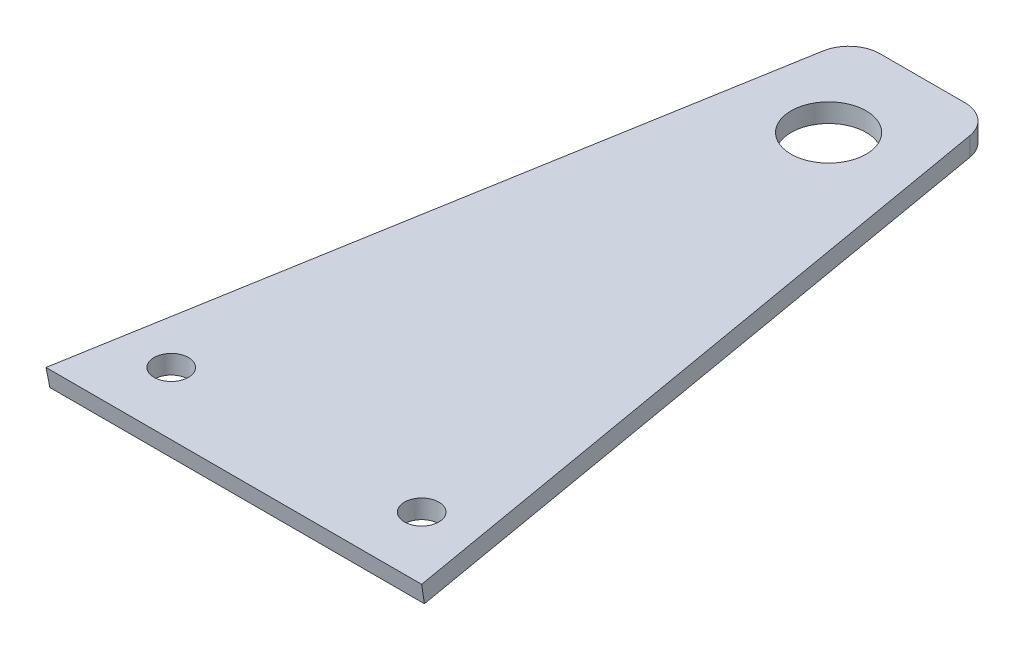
from build123d import *

# Parameters (mm, degrees)
SKETCH1_R          = 2.75
SKETCH1_R_2        = 6
EXTRUDE1_DEPTH     = 3
CUT_EXTRUDE1_DEPTH = 126.335549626


with BuildPart() as part:
    # Sketch1 → Extrude1 (new body)
    with BuildSketch(Plane(origin=(0, 0, 0), x_dir=(1, 0, 0), z_dir=(0, 1, 0))):
        with BuildLine():
            Line((18.283360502, 105.851034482), (0, 0))
            Line((0, 0), (60, 0))
            Line((60, 0), (41.716639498, 105.851034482))
            ThreePointArc((41.716639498, 105.851034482), (40.010220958, 108.824602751), (36.789597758, 110))
            Line((36.789597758, 110), (23.210402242, 110))
            ThreePointArc((23.210402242, 110), (19.989779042, 108.824602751), (18.283360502, 105.851034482))
        make_face()
        with Locations(Location((10, 10, 0), (0, 0, 270))):
            Circle(SKETCH1_R, mode=Mode.SUBTRACT)
        with Locations(Location((50, 10, 0), (0, 0, 270))):
            Circle(SKETCH1_R, mode=Mode.SUBTRACT)
        with Locations(Location((30, 95, 0), (0, 0, 270))):
            Circle(SKETCH1_R_2, mode=Mode.SUBTRACT)
    extrude(amount=EXTRUDE1_DEPTH)

    # Sketch2 → Cut-Extrude1 (cut, through all)
    with BuildSketch(Plane(origin=(0, 0, 0), x_dir=(0, 0, -1), z_dir=(1, 0, 0))):
        Polygon((0, 3), (5.577420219, -28.631121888), (0, -26.352154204), align=None)
    extrude(amount=CUT_EXTRUDE1_DEPTH, mode=Mode.SUBTRACT)


solid = part.part
